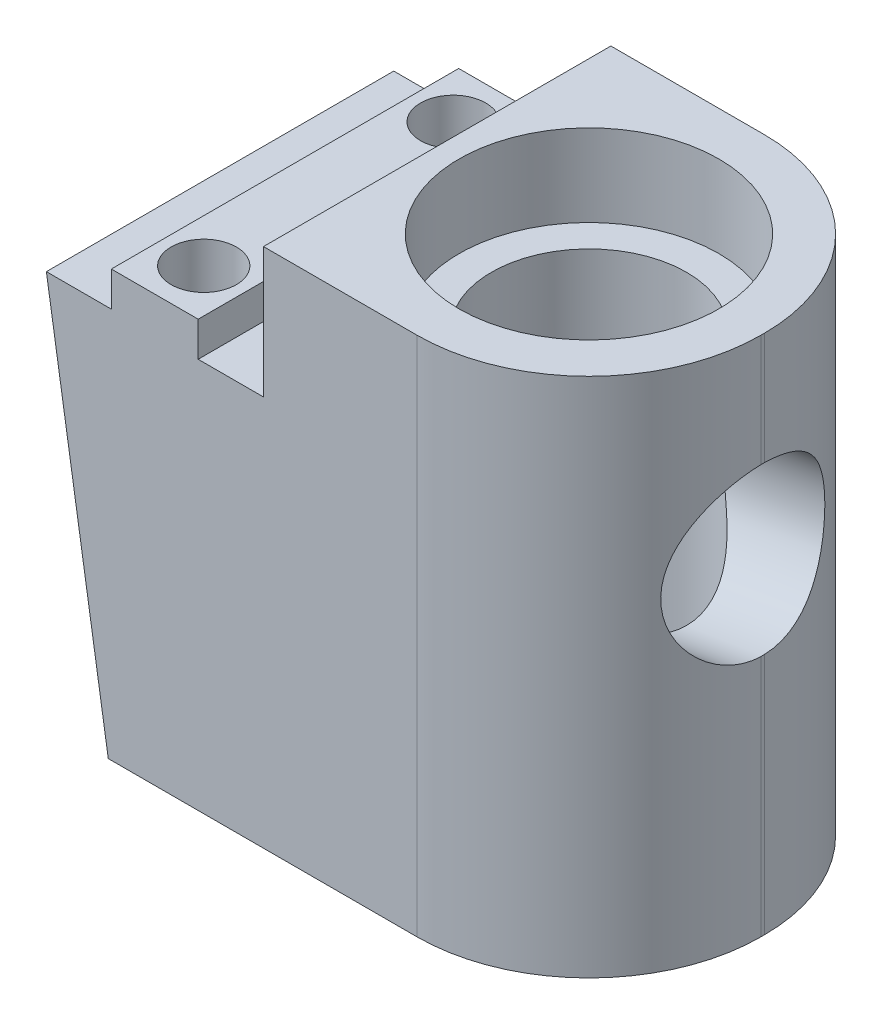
from build123d import *

# Parameters (mm, degrees)
BOSS_EXTRUDE1_DEPTH = 12.7
SKETCH3_R           = 9.4996
CUT_EXTRUDE1_DEPTH  = 5.9944
CUT_EXTRUDE2_START  = -5.9944
SKETCH4_R           = 9.4996
CUT_EXTRUDE2_DEPTH  = 5.9944
SKETCH5_R           = 7.1374
CUT_EXTRUDE3_DEPTH  = 33.655
FILLET1_R           = 12.573
SKETCH6_R           = 6
CUT_EXTRUDE4_DEPTH  = 51.435
SKETCH8_R           = 2.3876
CUT_EXTRUDE6_DEPTH  = 15.24
SKETCH9_R           = 2.3876
CUT_EXTRUDE7_DEPTH  = 14.2748


with BuildPart() as part:
    # Sketch2 → Boss-Extrude1 (new, symmetric)
    with BuildSketch(Plane.XY):
        Polygon((0, -19.05), (-4.973764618, -19.05), (-9.4996, 9.525), (-4.7498, 9.525), (-4.7498, 12.065), (1.6002, 12.065), (1.6002, 9.525), (6.3754, 9.525), (6.3754, 19.05), (30.1752, 19.05), (30.1752, -19.05), align=None)
    extrude(amount=BOSS_EXTRUDE1_DEPTH, both=True)

    # Sketch3 → Cut-Extrude1 (cut)
    with BuildSketch(Plane(origin=(0, 19.05, 0), x_dir=(1, 0, 0), z_dir=(0, 1, 0))):
        with Locations(Location((17.4752, 0, 0), (0, 0, 270))):
            Circle(SKETCH3_R)
    extrude(amount=-CUT_EXTRUDE1_DEPTH, mode=Mode.SUBTRACT)

    # Sketch4 → Cut-Extrude2 (cut)
    with BuildSketch(Plane.XZ.offset(19.05).offset(CUT_EXTRUDE2_START)):
        with Locations(Location((17.4752, 0, 0), (0, 0, 90))):
            Circle(SKETCH4_R)
    extrude(amount=CUT_EXTRUDE2_DEPTH, mode=Mode.SUBTRACT)

    # Sketch5 → Cut-Extrude3 (cut)
    with BuildSketch(Plane(origin=(0, 13.0556, 0), x_dir=(1, 0, 0), z_dir=(0, 1, 0))):
        with Locations(Location((17.4752, 0, 0), (0, 0, 270))):
            Circle(SKETCH5_R)
    extrude(amount=-CUT_EXTRUDE3_DEPTH, mode=Mode.SUBTRACT)

    # Fillet1
    fillet1_edges = [part.edges().sort_by_distance(p)[0] for p in [
        (30.1752, 0, -12.7),
        (30.1752, 0, 12.7),
    ]]
    fillet(fillet1_edges, radius=FILLET1_R)

    # Sketch6 → Cut-Extrude4 (cut)
    with BuildSketch(Plane(origin=(-7.795434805, -1.234675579, 0), x_dir=(0, 0, 1), z_dir=(-0.9876883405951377, -0.1564344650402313, 0))):
        with Locations(Location((0, 0, 0), (0, 0, 270))):
            Circle(SKETCH6_R)
    extrude(amount=-CUT_EXTRUDE4_DEPTH, mode=Mode.SUBTRACT)

    # Sketch8 → Cut-Extrude6 (cut)
    with BuildSketch(Plane(origin=(0, 12.065, 0), x_dir=(1, 0, 0), z_dir=(0, 1, 0))):
        with Locations(Location((-1.5748, 9.1186, 0), (0, 0, 180))):
            Circle(SKETCH8_R)
        with Locations(Location((-1.5748, -9.1186, 0), (0, 0, 180))):
            Circle(SKETCH8_R)
    extrude(amount=-CUT_EXTRUDE6_DEPTH, mode=Mode.SUBTRACT)

    # Sketch9 → Cut-Extrude7 (cut)
    with BuildSketch(Plane(origin=(-7.795434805, -1.234675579, 0), x_dir=(0, 0, 1), z_dir=(-0.9876883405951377, -0.1564344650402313, 0))):
        with Locations(Location((-8.7376, -13.4874, 0), (0, 0, 270))):
            Circle(SKETCH9_R)
        with Locations(Location((8.7376, -13.4874, 0), (0, 0, 270))):
            Circle(SKETCH9_R)
    extrude(amount=-CUT_EXTRUDE7_DEPTH, mode=Mode.SUBTRACT)


solid = part.part
